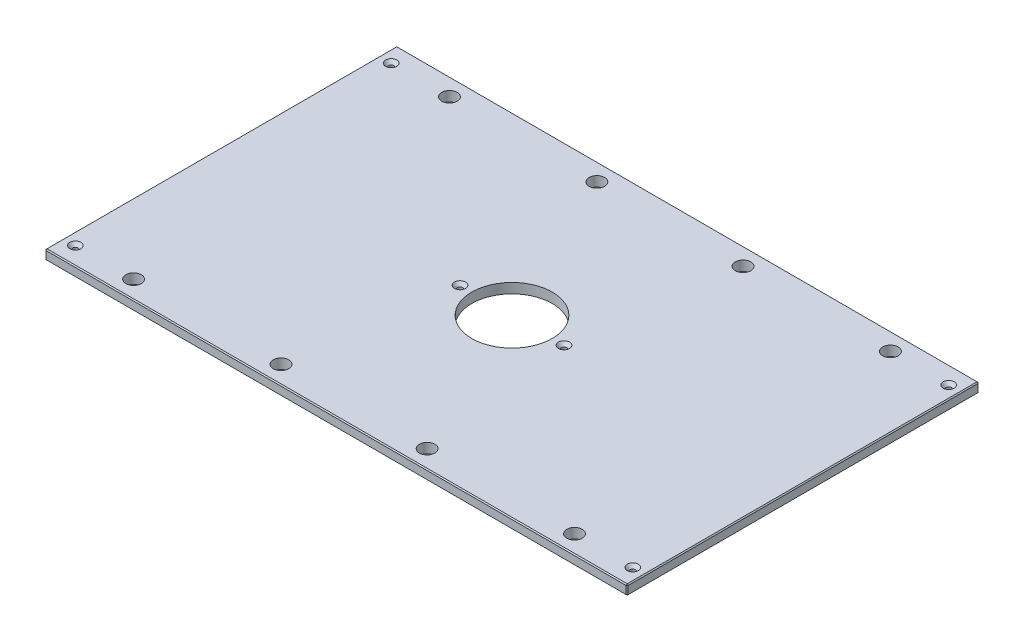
from build123d import *

# Parameters (mm, degrees)
SKETCH1_W                                        = 746.125
SKETCH1_H                                        = 450.85
BOSS_EXTRUDE1_DEPTH                              = 12.7
SKETCH13_R                                       = 51.562
CUT_EXTRUDE6_DEPTH                               = 437.065762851
F_25_32_0_78125_DIAMETER_HOLE1_D                 = 19.84375
CHAMFER2_SIZE                                    = 1.27
CSK_FOR_1_4_FLAT_HEAD_MACHINE_SCREW1_D           = 6.7564
CSK_FOR_1_4_FLAT_HEAD_MACHINE_SCREW1_CSINK_D     = 14.2748
CSK_FOR_1_4_FLAT_HEAD_MACHINE_SCREW1_CSINK_ANGLE = 82


with BuildPart() as part:
    # Sketch1 → Boss-Extrude1 (new body)
    with BuildSketch(Plane(origin=(0, 0, 0), x_dir=(1, 0, 0), z_dir=(0, 1, 0))):
        Rectangle(SKETCH1_W, SKETCH1_H)
    extrude(amount=BOSS_EXTRUDE1_DEPTH)

    # Sketch13 → Cut-Extrude6 (cut, through all)
    with BuildSketch(Plane(origin=(0, 12.7, 0), x_dir=(1, 0, 0), z_dir=(0, 1, 0))):
        with Locations(Location((0, 0, 0), (0, 0, 270))):
            Circle(SKETCH13_R)
    extrude(amount=-CUT_EXTRUDE6_DEPTH, mode=Mode.SUBTRACT)

    # 25_32 _0.78125_ Diameter Hole1 (through all)
    with Locations(Plane(origin=(0, 12.7, 0), x_dir=(1, 0, 0), z_dir=(0, 1, 0))):
        with Locations((282.575, 202.40498), (-282.575, 202.40498), (282.575, -202.40498), (-282.575, -202.40498), (-93.6625, 202.40498), (93.6625, 202.40498), (93.6625, -202.40498), (-93.6625, -202.40498)):
            Hole(F_25_32_0_78125_DIAMETER_HOLE1_D / 2)

    # Chamfer2
    chamfer2_edges = [part.edges().sort_by_distance(p)[0] for p in [
        (373.0625, 12.7, 0),
        (0, 12.7, -225.425),
        (-373.0625, 12.7, 0),
        (0, 0, -225.425),
        (373.0625, 0, 0),
        (0, 0, 225.425),
        (-373.0625, 0, 0),
        (0, 12.7, 225.425),
        (-373.0625, 6.35, -225.425),
        (373.0625, 6.35, -225.425),
        (373.0625, 6.35, 225.425),
        (-373.0625, 6.35, 225.425),
    ]]
    chamfer(chamfer2_edges, length=CHAMFER2_SIZE)

    # CSK for 1_4 Flat Head Machine Screw1 (through all)
    with Locations(Plane(origin=(0, 12.7, 0), x_dir=(1, 0, 0), z_dir=(0, 1, 0))):
        with Locations((357.1875, 202.40498), (357.1875, -202.40498), (-357.1875, -202.40498), (-66.675, 0), (66.675, 0), (-357.1875, 202.40498), (-282.575, 202.40498), (-282.575, -202.40498)):
            CounterSinkHole(CSK_FOR_1_4_FLAT_HEAD_MACHINE_SCREW1_D / 2, CSK_FOR_1_4_FLAT_HEAD_MACHINE_SCREW1_CSINK_D / 2, counter_sink_angle=CSK_FOR_1_4_FLAT_HEAD_MACHINE_SCREW1_CSINK_ANGLE)


solid = part.part
